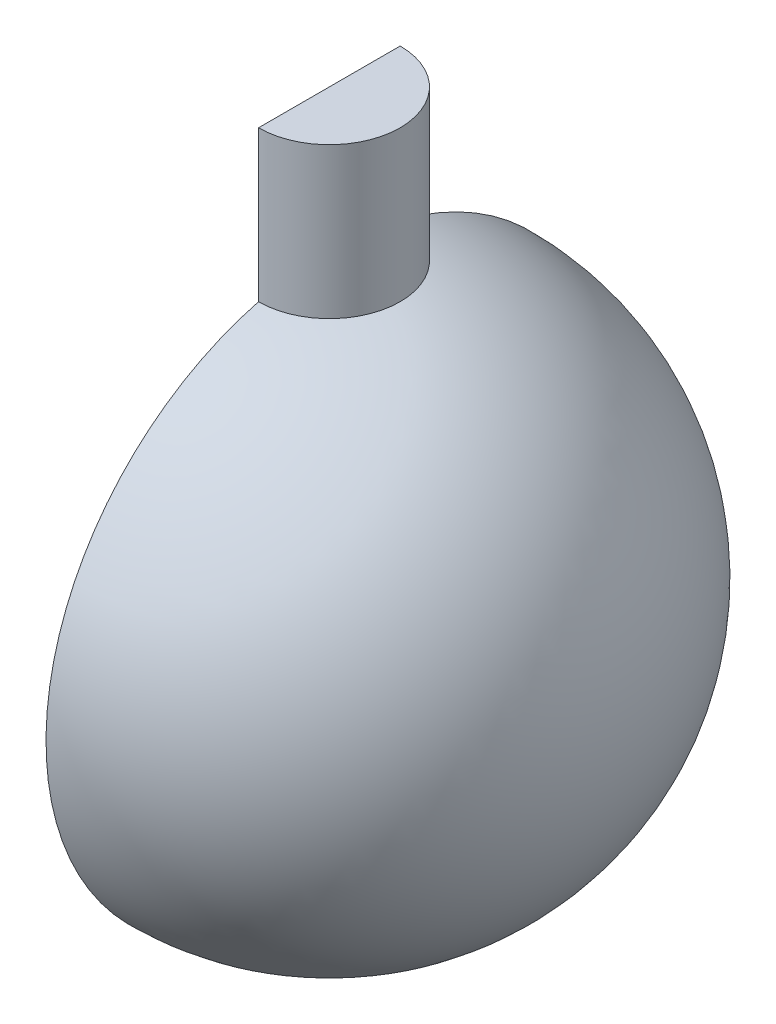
from build123d import *

# Parameters (mm, degrees)
BOSS_EXTRUDE1_REACH      = 111.434
BOSS_EXTRUDE1_END_RADIUS = 38.1
SKETCH3_R                = 9.525
SKETCH2_W                = 152.4
SKETCH2_H                = 152.4
CUT_EXTRUDE1_DEPTH       = 79.545162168


with BuildPart() as part:
    # Sketch1 → Revolve2 (revolve)
    with BuildSketch(Plane.XY):
        with BuildLine():
            Line((0, -38.1), (0, -29.633333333))
            ThreePointArc((0, -29.633333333), (-29.633333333, 0), (0, 29.633333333))
            Line((0, 29.633333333), (0, 38.1))
            ThreePointArc((0, 38.1), (-38.1, 0), (0, -38.1))
        make_face()
    revolve(axis=Axis((0, -38.1, 0), (0, 1, 0)))

    # Boss-Extrude1: up to this sphere (the profile starts outside it)
    boss_extrude1_end = Location((0, 0, 0)) * Sphere(BOSS_EXTRUDE1_END_RADIUS, mode=Mode.PRIVATE)
    # Sketch3 → Boss-Extrude1 (add, up to the surface)
    with BuildSketch(Plane(origin=(0, 57.15, 0), x_dir=(1, 0, 0), z_dir=(0, 1, 0)), mode=Mode.PRIVATE) as boss_extrude1_sk1:
        with Locations(Location((0, 0, 0), (0, 0, 270))):
            Circle(SKETCH3_R)
    boss_extrude1_tool1 = extrude(boss_extrude1_sk1.sketch, amount=-BOSS_EXTRUDE1_REACH, mode=Mode.PRIVATE) - boss_extrude1_end
    add(boss_extrude1_tool1.solids().sort_by_distance((0, 57.15, 0))[0])

    # Sketch2 → Cut-Extrude1 (cut, through all)
    with BuildSketch(Plane(origin=(0, 0, 0), x_dir=(0, 0, -1), z_dir=(1, 0, 0))):
        Rectangle(SKETCH2_W, SKETCH2_H)
    extrude(amount=-CUT_EXTRUDE1_DEPTH, mode=Mode.SUBTRACT)


solid = part.part
